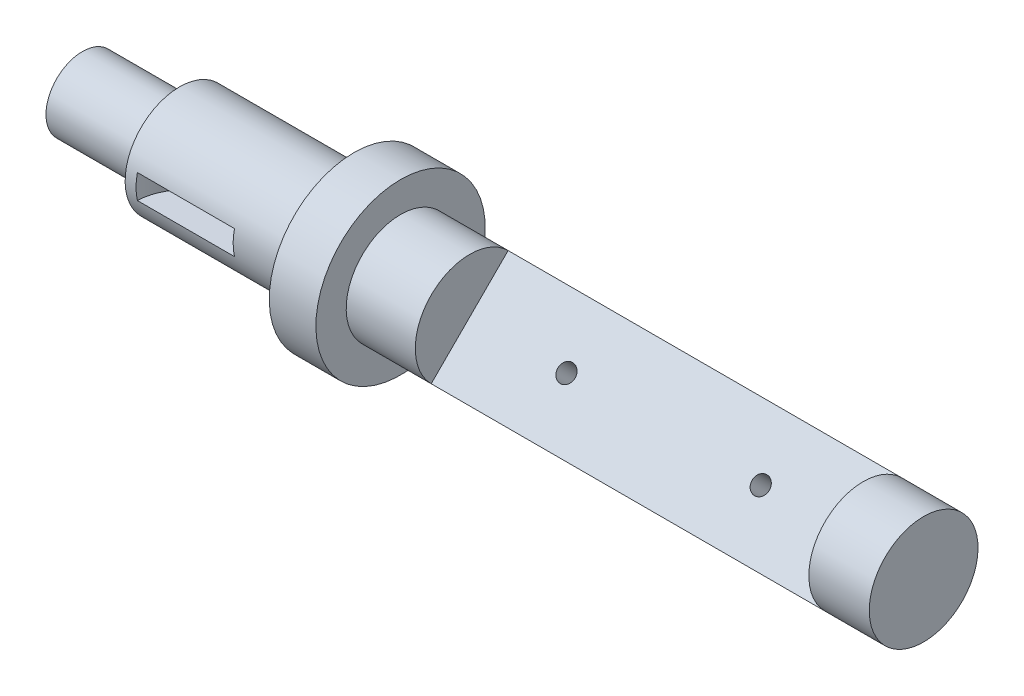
ISO-10303-21;
HEADER;
FILE_DESCRIPTION(('STEP AP214'),'2;1');
FILE_NAME('part.step','',(''),(''),'','','');
FILE_SCHEMA(('AUTOMOTIVE_DESIGN { 1 0 10303 214 1 1 1 1 }'));
ENDSEC;
DATA;
#1=APPLICATION_CONTEXT('core data for automotive mechanical design processes');
#2=APPLICATION_PROTOCOL_DEFINITION('international standard','automotive_design',2000,#1);
#3=PRODUCT_CONTEXT('',#1,'mechanical');
#4=PRODUCT('Part','Part','',(#3));
#5=PRODUCT_RELATED_PRODUCT_CATEGORY('part','',(#4));
#6=PRODUCT_DEFINITION_FORMATION('','',#4);
#7=PRODUCT_DEFINITION_CONTEXT('part definition',#1,'design');
#8=PRODUCT_DEFINITION('design','',#6,#7);
#9=PRODUCT_DEFINITION_SHAPE('','',#8);
#10=(LENGTH_UNIT() NAMED_UNIT(*) SI_UNIT(.MILLI.,.METRE.));
#11=(NAMED_UNIT(*) PLANE_ANGLE_UNIT() SI_UNIT($,.RADIAN.));
#12=(NAMED_UNIT(*) SI_UNIT($,.STERADIAN.) SOLID_ANGLE_UNIT());
#13=UNCERTAINTY_MEASURE_WITH_UNIT(LENGTH_MEASURE(1.E-05),#10,'distance_accuracy_value','');
#14=(GEOMETRIC_REPRESENTATION_CONTEXT(3) GLOBAL_UNCERTAINTY_ASSIGNED_CONTEXT((#13)) GLOBAL_UNIT_ASSIGNED_CONTEXT((#10,
#11,#12)) REPRESENTATION_CONTEXT('',''));
#15=CARTESIAN_POINT('',(0.,0.,0.));
#16=DIRECTION('',(0.,0.,1.));
#17=DIRECTION('',(1.,0.,0.));
#18=AXIS2_PLACEMENT_3D('',#15,#16,#17);
#19=CARTESIAN_POINT('',(102.,0.,0.));
#20=DIRECTION('',(1.,0.,0.));
#21=DIRECTION('',(0.,1.,0.));
#22=AXIS2_PLACEMENT_3D('',#19,#20,#21);
#23=CYLINDRICAL_SURFACE('',#22,7.11199999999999);
#24=DIRECTION('',(1.,0.,0.));
#25=VECTOR('',#24,1.);
#26=CARTESIAN_POINT('',(102.,-1.58749999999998,6.93255997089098));
#27=LINE('',#26,#25);
#28=CARTESIAN_POINT('',(6.12493583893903,-1.58749999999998,6.93255997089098));
#29=VERTEX_POINT('',#28);
#30=CARTESIAN_POINT('',(18.819864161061,-1.58749999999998,6.93255997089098));
#31=VERTEX_POINT('',#30);
#32=EDGE_CURVE('E13',#29,#31,#27,.T.);
#33=ORIENTED_EDGE('',*,*,#32,.F.);
#34=CARTESIAN_POINT('',(6.12493583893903,1.58750000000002,6.93255997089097));
#35=CARTESIAN_POINT('',(6.12430253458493,1.48918668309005,6.95507276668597));
#36=CARTESIAN_POINT('',(6.12384159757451,1.39040619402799,6.97549148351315));
#37=CARTESIAN_POINT('',(6.12315874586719,1.19206519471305,7.01211079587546));
#38=CARTESIAN_POINT('',(6.12293683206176,1.09250468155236,7.02831137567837));
#39=CARTESIAN_POINT('',(6.12247098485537,0.792837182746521,7.07054757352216));
#40=CARTESIAN_POINT('',(6.12242715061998,0.591792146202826,7.09020668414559));
#41=CARTESIAN_POINT('',(6.12239127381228,0.192533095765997,7.11215309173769));
#42=CARTESIAN_POINT('',(6.1223982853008,-0.00566422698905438,7.11475596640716));
#43=CARTESIAN_POINT('',(6.12240305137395,-0.401492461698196,7.10341548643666));
#44=CARTESIAN_POINT('',(6.12240081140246,-0.599123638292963,7.08948186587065));
#45=CARTESIAN_POINT('',(6.12266247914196,-0.928464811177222,7.05239884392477));
#46=CARTESIAN_POINT('',(6.1228400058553,-1.0606961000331,7.03372456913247));
#47=CARTESIAN_POINT('',(6.12355784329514,-1.32473608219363,6.98882477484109));
#48=CARTESIAN_POINT('',(6.12410045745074,-1.45653671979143,6.96255191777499));
#49=CARTESIAN_POINT('',(6.12493583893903,-1.58749999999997,6.93255997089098));
#50=B_SPLINE_CURVE_WITH_KNOTS('',3,(#34,#35,#36,#37,#38,#39,#40,#41,#42,#43,#44,#45,#46,#47,#48,
#49),.UNSPECIFIED.,.F.,.F.,(4,2,2,2,2,2,2,4),(0.,0.302530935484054,0.605062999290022,
1.21027408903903,1.80425504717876,2.39788653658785,2.79831956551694,3.20130301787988),.UNSPECIFIED.);
#51=CARTESIAN_POINT('',(6.12493583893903,1.58750000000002,6.93255997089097));
#52=VERTEX_POINT('',#51);
#53=EDGE_CURVE('E89',#52,#29,#50,.T.);
#54=ORIENTED_EDGE('',*,*,#53,.F.);
#55=DIRECTION('',(1.,0.,0.));
#56=VECTOR('',#55,1.);
#57=CARTESIAN_POINT('',(102.,1.58750000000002,6.93255997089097));
#58=LINE('',#57,#56);
#59=CARTESIAN_POINT('',(18.819864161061,1.58750000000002,6.93255997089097));
#60=VERTEX_POINT('',#59);
#61=EDGE_CURVE('E85',#52,#60,#58,.T.);
#62=ORIENTED_EDGE('',*,*,#61,.T.);
#63=CARTESIAN_POINT('',(18.819864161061,-1.58749999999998,6.93255997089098));
#64=CARTESIAN_POINT('',(18.8204974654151,-1.48918668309,6.95507276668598));
#65=CARTESIAN_POINT('',(18.8209584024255,-1.39040619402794,6.97549148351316));
#66=CARTESIAN_POINT('',(18.8216412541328,-1.192065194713,7.01211079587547));
#67=CARTESIAN_POINT('',(18.8218631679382,-1.09250468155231,7.02831137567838));
#68=CARTESIAN_POINT('',(18.8223290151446,-0.79283718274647,7.07054757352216));
#69=CARTESIAN_POINT('',(18.82237284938,-0.591792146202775,7.0902066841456));
#70=CARTESIAN_POINT('',(18.8224087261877,-0.192533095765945,7.11215309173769));
#71=CARTESIAN_POINT('',(18.8224017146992,0.00566422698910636,7.11475596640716));
#72=CARTESIAN_POINT('',(18.822396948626,0.401492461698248,7.10341548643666));
#73=CARTESIAN_POINT('',(18.8223991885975,0.599123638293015,7.08948186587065));
#74=CARTESIAN_POINT('',(18.822137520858,0.928464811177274,7.05239884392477));
#75=CARTESIAN_POINT('',(18.8219599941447,1.06069610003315,7.03372456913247));
#76=CARTESIAN_POINT('',(18.8212421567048,1.32473608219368,6.98882477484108));
#77=CARTESIAN_POINT('',(18.8206995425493,1.45653671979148,6.96255191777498));
#78=CARTESIAN_POINT('',(18.819864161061,1.58750000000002,6.93255997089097));
#79=B_SPLINE_CURVE_WITH_KNOTS('',3,(#63,#64,#65,#66,#67,#68,#69,#70,#71,#72,#73,#74,#75,#76,#77,
#78),.UNSPECIFIED.,.F.,.F.,(4,2,2,2,2,2,2,4),(0.,0.302530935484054,0.605062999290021,
1.21027408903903,1.80425504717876,2.39788653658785,2.79831956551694,3.20130301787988),.UNSPECIFIED.);
#80=EDGE_CURVE('E54',#31,#60,#79,.T.);
#81=ORIENTED_EDGE('',*,*,#80,.F.);
#82=EDGE_LOOP('',(#33,#54,#62,#81));
#83=FACE_BOUND('',#82,.T.);
#84=CARTESIAN_POINT('',(27.5092,0.,0.));
#85=DIRECTION('',(1.,0.,0.));
#86=DIRECTION('',(0.,1.,0.));
#87=AXIS2_PLACEMENT_3D('',#84,#85,#86);
#88=CIRCLE('',#87,7.11199999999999);
#89=CARTESIAN_POINT('',(27.5092,7.11199999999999,0.));
#90=VERTEX_POINT('',#89);
#91=EDGE_CURVE('E182',#90,#90,#88,.T.);
#92=ORIENTED_EDGE('',*,*,#91,.F.);
#93=EDGE_LOOP('',(#92));
#94=FACE_BOUND('',#93,.T.);
#95=CARTESIAN_POINT('',(4.7,0.,0.));
#96=DIRECTION('',(1.,0.,0.));
#97=DIRECTION('',(0.,1.,0.));
#98=AXIS2_PLACEMENT_3D('',#95,#96,#97);
#99=CIRCLE('',#98,7.112);
#100=CARTESIAN_POINT('',(4.7,7.112,0.));
#101=VERTEX_POINT('',#100);
#102=EDGE_CURVE('E185',#101,#101,#99,.T.);
#103=ORIENTED_EDGE('',*,*,#102,.T.);
#104=EDGE_LOOP('',(#103));
#105=FACE_BOUND('',#104,.T.);
#106=ADVANCED_FACE('F46',(#83,#94,#105),#23,.T.);
#107=CARTESIAN_POINT('',(-8.,0.,0.));
#108=DIRECTION('',(-1.,0.,0.));
#109=DIRECTION('',(0.,-1.,0.));
#110=AXIS2_PLACEMENT_3D('',#107,#108,#109);
#111=PLANE('',#110);
#112=CARTESIAN_POINT('',(-8.00000000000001,0.,0.));
#113=DIRECTION('',(1.,0.,0.));
#114=DIRECTION('',(0.,1.,0.));
#115=AXIS2_PLACEMENT_3D('',#112,#113,#114);
#116=CIRCLE('',#115,4.7625);
#117=CARTESIAN_POINT('',(-8.00000000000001,4.7625,0.));
#118=VERTEX_POINT('',#117);
#119=EDGE_CURVE('E90',#118,#118,#116,.T.);
#120=ORIENTED_EDGE('',*,*,#119,.F.);
#121=EDGE_LOOP('',(#120));
#122=FACE_BOUND('',#121,.T.);
#123=ADVANCED_FACE('F48',(#122),#111,.T.);
#124=CARTESIAN_POINT('',(102.,0.,0.));
#125=DIRECTION('',(1.,0.,0.));
#126=DIRECTION('',(0.,1.,0.));
#127=AXIS2_PLACEMENT_3D('',#124,#125,#126);
#128=CYLINDRICAL_SURFACE('',#127,4.7625);
#129=ORIENTED_EDGE('',*,*,#119,.T.);
#130=EDGE_LOOP('',(#129));
#131=FACE_BOUND('',#130,.T.);
#132=CARTESIAN_POINT('',(4.7,0.,0.));
#133=DIRECTION('',(1.,0.,0.));
#134=DIRECTION('',(0.,1.,0.));
#135=AXIS2_PLACEMENT_3D('',#132,#133,#134);
#136=CIRCLE('',#135,4.7625);
#137=CARTESIAN_POINT('',(4.7,4.7625,0.));
#138=VERTEX_POINT('',#137);
#139=EDGE_CURVE('E188',#138,#138,#136,.T.);
#140=ORIENTED_EDGE('',*,*,#139,.F.);
#141=EDGE_LOOP('',(#140));
#142=FACE_BOUND('',#141,.T.);
#143=ADVANCED_FACE('F193',(#131,#142),#128,.T.);
#144=CARTESIAN_POINT('',(4.7,4.7625,0.));
#145=DIRECTION('',(-1.,0.,0.));
#146=DIRECTION('',(0.,-1.,0.));
#147=AXIS2_PLACEMENT_3D('',#144,#145,#146);
#148=PLANE('',#147);
#149=ORIENTED_EDGE('',*,*,#139,.T.);
#150=EDGE_LOOP('',(#149));
#151=FACE_BOUND('',#150,.T.);
#152=ORIENTED_EDGE('',*,*,#102,.F.);
#153=EDGE_LOOP('',(#152));
#154=FACE_BOUND('',#153,.T.);
#155=ADVANCED_FACE('F201',(#151,#154),#148,.T.);
#156=CARTESIAN_POINT('',(27.5092,7.11199999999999,0.));
#157=DIRECTION('',(-1.,0.,0.));
#158=DIRECTION('',(0.,-1.,0.));
#159=AXIS2_PLACEMENT_3D('',#156,#157,#158);
#160=PLANE('',#159);
#161=ORIENTED_EDGE('',*,*,#91,.T.);
#162=EDGE_LOOP('',(#161));
#163=FACE_BOUND('',#162,.T.);
#164=CARTESIAN_POINT('',(27.5092,0.,0.));
#165=DIRECTION('',(1.,0.,0.));
#166=DIRECTION('',(0.,1.,0.));
#167=AXIS2_PLACEMENT_3D('',#164,#165,#166);
#168=CIRCLE('',#167,11.0744);
#169=CARTESIAN_POINT('',(27.5092,11.0744,0.));
#170=VERTEX_POINT('',#169);
#171=EDGE_CURVE('E179',#170,#170,#168,.T.);
#172=ORIENTED_EDGE('',*,*,#171,.F.);
#173=EDGE_LOOP('',(#172));
#174=FACE_BOUND('',#173,.T.);
#175=ADVANCED_FACE('F316',(#163,#174),#160,.T.);
#176=CARTESIAN_POINT('',(102.,0.,0.));
#177=DIRECTION('',(1.,0.,0.));
#178=DIRECTION('',(0.,1.,0.));
#179=AXIS2_PLACEMENT_3D('',#176,#177,#178);
#180=CYLINDRICAL_SURFACE('',#179,11.0744);
#181=ORIENTED_EDGE('',*,*,#171,.T.);
#182=EDGE_LOOP('',(#181));
#183=FACE_BOUND('',#182,.T.);
#184=CARTESIAN_POINT('',(33.6052,0.,0.));
#185=DIRECTION('',(1.,0.,0.));
#186=DIRECTION('',(0.,1.,0.));
#187=AXIS2_PLACEMENT_3D('',#184,#185,#186);
#188=CIRCLE('',#187,11.0744);
#189=CARTESIAN_POINT('',(33.6052,11.0744,0.));
#190=VERTEX_POINT('',#189);
#191=EDGE_CURVE('E176',#190,#190,#188,.T.);
#192=ORIENTED_EDGE('',*,*,#191,.F.);
#193=EDGE_LOOP('',(#192));
#194=FACE_BOUND('',#193,.T.);
#195=ADVANCED_FACE('F308',(#183,#194),#180,.T.);
#196=CARTESIAN_POINT('',(33.6052,11.0744,0.));
#197=DIRECTION('',(1.,0.,0.));
#198=DIRECTION('',(0.,1.,0.));
#199=AXIS2_PLACEMENT_3D('',#196,#197,#198);
#200=PLANE('',#199);
#201=ORIENTED_EDGE('',*,*,#191,.T.);
#202=EDGE_LOOP('',(#201));
#203=FACE_BOUND('',#202,.T.);
#204=CARTESIAN_POINT('',(33.6052,0.,0.));
#205=DIRECTION('',(1.,0.,0.));
#206=DIRECTION('',(0.,1.,0.));
#207=AXIS2_PLACEMENT_3D('',#204,#205,#206);
#208=CIRCLE('',#207,7.11199999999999);
#209=CARTESIAN_POINT('',(33.6052,7.11199999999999,0.));
#210=VERTEX_POINT('',#209);
#211=EDGE_CURVE('E173',#210,#210,#208,.T.);
#212=ORIENTED_EDGE('',*,*,#211,.F.);
#213=EDGE_LOOP('',(#212));
#214=FACE_BOUND('',#213,.T.);
#215=ADVANCED_FACE('F146',(#203,#214),#200,.T.);
#216=CARTESIAN_POINT('',(102.,0.,0.));
#217=DIRECTION('',(1.,0.,0.));
#218=DIRECTION('',(0.,1.,0.));
#219=AXIS2_PLACEMENT_3D('',#216,#217,#218);
#220=CYLINDRICAL_SURFACE('',#219,7.11199999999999);
#221=CARTESIAN_POINT('',(80.696799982,-5.76426877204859,-4.16578318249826));
#222=CARTESIAN_POINT('',(80.6337421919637,-5.76426773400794,-4.16578577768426));
#223=CARTESIAN_POINT('',(80.5706489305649,-5.76113199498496,-4.17013425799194));
#224=CARTESIAN_POINT('',(80.4462297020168,-5.74862575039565,-4.18735655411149));
#225=CARTESIAN_POINT('',(80.384905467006,-5.73924933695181,-4.20023844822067));
#226=CARTESIAN_POINT('',(80.2658430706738,-5.71440168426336,-4.23398079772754));
#227=CARTESIAN_POINT('',(80.2081020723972,-5.69893533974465,-4.25483484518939));
#228=CARTESIAN_POINT('',(80.0977560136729,-5.66213262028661,-4.30368785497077));
#229=CARTESIAN_POINT('',(80.0451503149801,-5.64079697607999,-4.33168592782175));
#230=CARTESIAN_POINT('',(79.9460889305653,-5.59237769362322,-4.39402108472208));
#231=CARTESIAN_POINT('',(79.8996860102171,-5.56524928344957,-4.4284072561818));
#232=CARTESIAN_POINT('',(79.8148051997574,-5.50579084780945,-4.50211604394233));
#233=CARTESIAN_POINT('',(79.7763277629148,-5.47346052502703,-4.54143894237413));
#234=CARTESIAN_POINT('',(79.7081936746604,-5.40400354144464,-4.62387346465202));
#235=CARTESIAN_POINT('',(79.6785858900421,-5.36685186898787,-4.66700444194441));
#236=CARTESIAN_POINT('',(79.6293454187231,-5.28868162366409,-4.75540406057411));
#237=CARTESIAN_POINT('',(79.6097121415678,-5.24766327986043,-4.80067257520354));
#238=CARTESIAN_POINT('',(79.5811387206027,-5.1631146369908,-4.89148298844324));
#239=CARTESIAN_POINT('',(79.5721100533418,-5.11960835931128,-4.93701938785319));
#240=CARTESIAN_POINT('',(79.5647270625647,-5.03094384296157,-5.02734040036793));
#241=CARTESIAN_POINT('',(79.5663720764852,-4.9857857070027,-5.07212505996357));
#242=CARTESIAN_POINT('',(79.5802203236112,-4.89554999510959,-5.15926687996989));
#243=CARTESIAN_POINT('',(79.5923283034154,-4.85047535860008,-5.20164227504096));
#244=CARTESIAN_POINT('',(79.6266090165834,-4.76138132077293,-5.28331777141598));
#245=CARTESIAN_POINT('',(79.6487820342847,-4.71736194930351,-5.32261778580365));
#246=CARTESIAN_POINT('',(79.7026594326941,-4.63160602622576,-5.39740898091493));
#247=CARTESIAN_POINT('',(79.7344034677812,-4.58987984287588,-5.4328834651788));
#248=CARTESIAN_POINT('',(79.8064928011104,-4.51030134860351,-5.49912816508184));
#249=CARTESIAN_POINT('',(79.8468387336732,-4.47244932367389,-5.52989803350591));
#250=CARTESIAN_POINT('',(79.9355160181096,-4.40154380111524,-5.58650526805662));
#251=CARTESIAN_POINT('',(79.9839305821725,-4.3685478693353,-5.61228445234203));
#252=CARTESIAN_POINT('',(80.0870893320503,-4.30908614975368,-5.65806797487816));
#253=CARTESIAN_POINT('',(80.1418335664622,-4.28262041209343,-5.67807226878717));
#254=CARTESIAN_POINT('',(80.2561879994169,-4.23723471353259,-5.71202187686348));
#255=CARTESIAN_POINT('',(80.3158027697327,-4.21832194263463,-5.72596141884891));
#256=CARTESIAN_POINT('',(80.4381563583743,-4.18886315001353,-5.74754784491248));
#257=CARTESIAN_POINT('',(80.5008949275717,-4.17831646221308,-5.75519522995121));
#258=CARTESIAN_POINT('',(80.6269848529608,-4.16610850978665,-5.76403859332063));
#259=CARTESIAN_POINT('',(80.6903221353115,-4.16435190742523,-5.76530379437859));
#260=CARTESIAN_POINT('',(80.8164497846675,-4.16954129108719,-5.76155181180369));
#261=CARTESIAN_POINT('',(80.8792401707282,-4.17648697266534,-5.75653484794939));
#262=CARTESIAN_POINT('',(81.0021263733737,-4.19872046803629,-5.74033761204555));
#263=CARTESIAN_POINT('',(81.0622354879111,-4.21396059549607,-5.72919256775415));
#264=CARTESIAN_POINT('',(81.1784736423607,-4.25212929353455,-5.70092107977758));
#265=CARTESIAN_POINT('',(81.2346024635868,-4.27505828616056,-5.68379430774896));
#266=CARTESIAN_POINT('',(81.3418064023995,-4.32793571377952,-5.64363568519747));
#267=CARTESIAN_POINT('',(81.3928349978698,-4.35794161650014,-5.62055533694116));
#268=CARTESIAN_POINT('',(81.4879103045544,-4.42374276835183,-5.56891271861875));
#269=CARTESIAN_POINT('',(81.5319565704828,-4.45953838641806,-5.54035009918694));
#270=CARTESIAN_POINT('',(81.6122384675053,-4.53600260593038,-5.47792646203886));
#271=CARTESIAN_POINT('',(81.6483967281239,-4.57671387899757,-5.44401813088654));
#272=CARTESIAN_POINT('',(81.7113356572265,-4.66131720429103,-5.37175542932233));
#273=CARTESIAN_POINT('',(81.7381166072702,-4.70520916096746,-5.33340119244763));
#274=CARTESIAN_POINT('',(81.781418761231,-4.79451795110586,-5.25325837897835));
#275=CARTESIAN_POINT('',(81.7979813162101,-4.83992784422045,-5.21148442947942));
#276=CARTESIAN_POINT('',(81.8205100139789,-4.93098338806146,-5.12541402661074));
#277=CARTESIAN_POINT('',(81.82647694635,-4.97662902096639,-5.08111776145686));
#278=CARTESIAN_POINT('',(81.8276239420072,-5.06627316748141,-4.99173149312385));
#279=CARTESIAN_POINT('',(81.8229220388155,-5.11028428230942,-4.94665559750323));
#280=CARTESIAN_POINT('',(81.8031190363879,-5.19597176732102,-4.8565715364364));
#281=CARTESIAN_POINT('',(81.788017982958,-5.23764814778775,-4.81156337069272));
#282=CARTESIAN_POINT('',(81.747889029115,-5.31759462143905,-4.72305912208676));
#283=CARTESIAN_POINT('',(81.7228702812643,-5.35586781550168,-4.6795616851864));
#284=CARTESIAN_POINT('',(81.6636289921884,-5.42821747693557,-4.59544130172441));
#285=CARTESIAN_POINT('',(81.6294060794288,-5.46229377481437,-4.55481847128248));
#286=CARTESIAN_POINT('',(81.5523054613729,-5.52593161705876,-4.47740601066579));
#287=CARTESIAN_POINT('',(81.5093409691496,-5.55544220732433,-4.44066092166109));
#288=CARTESIAN_POINT('',(81.416159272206,-5.60901484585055,-4.3727989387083));
#289=CARTESIAN_POINT('',(81.3659403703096,-5.63307561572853,-4.3416833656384));
#290=CARTESIAN_POINT('',(81.2592972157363,-5.67550049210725,-4.28607894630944));
#291=CARTESIAN_POINT('',(81.2028354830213,-5.69382734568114,-4.26163356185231));
#292=CARTESIAN_POINT('',(81.0855891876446,-5.72428687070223,-4.22063286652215));
#293=CARTESIAN_POINT('',(81.0248090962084,-5.73642584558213,-4.20406952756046));
#294=CARTESIAN_POINT('',(80.9192788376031,-5.75166922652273,-4.18317509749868));
#295=CARTESIAN_POINT('',(80.8751739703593,-5.7563901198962,-4.17666683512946));
#296=CARTESIAN_POINT('',(80.786318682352,-5.76269023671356,-4.16796998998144));
#297=CARTESIAN_POINT('',(80.7415682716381,-5.76426950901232,-4.16578134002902));
#298=CARTESIAN_POINT('',(80.696799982,-5.76426877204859,-4.16578318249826));
#299=B_SPLINE_CURVE_WITH_KNOTS('',3,(#221,#222,#223,#224,#225,#226,#227,#228,#229,#230,#231,
#232,#233,#234,#235,#236,#237,#238,#239,#240,#241,#242,#243,#244,#245,#246,#247,#248,#249,#250,
#251,#252,#253,#254,#255,#256,#257,#258,#259,#260,#261,#262,#263,#264,#265,#266,#267,#268,#269,
#270,#271,#272,#273,#274,#275,#276,#277,#278,#279,#280,#281,#282,#283,#284,#285,#286,#287,#288,
#289,#290,#291,#292,#293,#294,#295,#296,#297,#298),.UNSPECIFIED.,.T.,.F.,(4,2,2,2,2,2,2,2,2,2,2,
2,2,2,2,2,2,2,2,2,2,2,2,2,2,2,2,2,2,2,2,2,2,2,2,2,2,2,4),(0.,0.189009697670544,
0.378198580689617,0.567235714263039,0.756249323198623,0.946780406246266,1.13732238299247,
1.32889560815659,1.52045749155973,1.71040865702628,1.90034803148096,2.08857622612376,
2.27680973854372,2.46583410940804,2.65487242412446,2.84599693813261,3.03712291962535,
3.22843041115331,3.41972266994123,3.60893559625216,3.79814190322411,3.98627174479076,
4.17441191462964,4.36413592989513,4.55387203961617,4.74539295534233,4.93690812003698,
5.12764310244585,5.31836387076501,5.5069849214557,5.6956051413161,5.88405169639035,
6.07250585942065,6.2629313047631,6.4534013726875,6.64508438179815,6.83657173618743,
6.97076249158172,7.10495116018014),.UNSPECIFIED.);
#300=CARTESIAN_POINT('',(80.696799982,-5.76426877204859,-4.16578318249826));
#301=VERTEX_POINT('',#300);
#302=EDGE_CURVE('E129',#301,#301,#299,.T.);
#303=ORIENTED_EDGE('',*,*,#302,.F.);
#304=EDGE_LOOP('',(#303));
#305=FACE_BOUND('',#304,.T.);
#306=CARTESIAN_POINT('',(55.296799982,-5.76426877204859,-4.16578318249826));
#307=CARTESIAN_POINT('',(55.2337421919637,-5.76426773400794,-4.16578577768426));
#308=CARTESIAN_POINT('',(55.1706489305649,-5.76113199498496,-4.17013425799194));
#309=CARTESIAN_POINT('',(55.0462297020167,-5.74862575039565,-4.18735655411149));
#310=CARTESIAN_POINT('',(54.984905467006,-5.73924933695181,-4.20023844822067));
#311=CARTESIAN_POINT('',(54.8658430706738,-5.71440168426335,-4.23398079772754));
#312=CARTESIAN_POINT('',(54.8081020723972,-5.69893533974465,-4.25483484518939));
#313=CARTESIAN_POINT('',(54.6977560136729,-5.66213262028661,-4.30368785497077));
#314=CARTESIAN_POINT('',(54.6451503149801,-5.64079697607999,-4.33168592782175));
#315=CARTESIAN_POINT('',(54.5460889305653,-5.59237769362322,-4.39402108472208));
#316=CARTESIAN_POINT('',(54.4996860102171,-5.56524928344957,-4.4284072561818));
#317=CARTESIAN_POINT('',(54.4148051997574,-5.50579084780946,-4.50211604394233));
#318=CARTESIAN_POINT('',(54.3763277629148,-5.47346052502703,-4.54143894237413));
#319=CARTESIAN_POINT('',(54.3081936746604,-5.40400354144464,-4.62387346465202));
#320=CARTESIAN_POINT('',(54.2785858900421,-5.36685186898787,-4.66700444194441));
#321=CARTESIAN_POINT('',(54.2293454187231,-5.28868162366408,-4.75540406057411));
#322=CARTESIAN_POINT('',(54.2097121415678,-5.24766327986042,-4.80067257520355));
#323=CARTESIAN_POINT('',(54.1811387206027,-5.16311463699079,-4.89148298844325));
#324=CARTESIAN_POINT('',(54.1721100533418,-5.11960835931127,-4.9370193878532));
#325=CARTESIAN_POINT('',(54.1647270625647,-5.03094384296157,-5.02734040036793));
#326=CARTESIAN_POINT('',(54.1663720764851,-4.9857857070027,-5.07212505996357));
#327=CARTESIAN_POINT('',(54.1802203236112,-4.89554999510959,-5.15926687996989));
#328=CARTESIAN_POINT('',(54.1923283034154,-4.85047535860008,-5.20164227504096));
#329=CARTESIAN_POINT('',(54.2266090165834,-4.76138132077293,-5.28331777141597));
#330=CARTESIAN_POINT('',(54.2487820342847,-4.71736194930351,-5.32261778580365));
#331=CARTESIAN_POINT('',(54.3026594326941,-4.63160602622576,-5.39740898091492));
#332=CARTESIAN_POINT('',(54.3344034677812,-4.58987984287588,-5.43288346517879));
#333=CARTESIAN_POINT('',(54.4064928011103,-4.51030134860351,-5.49912816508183));
#334=CARTESIAN_POINT('',(54.4468387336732,-4.47244932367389,-5.5298980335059));
#335=CARTESIAN_POINT('',(54.5355160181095,-4.40154380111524,-5.58650526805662));
#336=CARTESIAN_POINT('',(54.5839305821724,-4.3685478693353,-5.61228445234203));
#337=CARTESIAN_POINT('',(54.6870893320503,-4.30908614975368,-5.65806797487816));
#338=CARTESIAN_POINT('',(54.7418335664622,-4.28262041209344,-5.67807226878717));
#339=CARTESIAN_POINT('',(54.8561879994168,-4.23723471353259,-5.71202187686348));
#340=CARTESIAN_POINT('',(54.9158027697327,-4.21832194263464,-5.72596141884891));
#341=CARTESIAN_POINT('',(55.0381563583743,-4.18886315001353,-5.74754784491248));
#342=CARTESIAN_POINT('',(55.1008949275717,-4.17831646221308,-5.75519522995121));
#343=CARTESIAN_POINT('',(55.2269848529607,-4.16610850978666,-5.76403859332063));
#344=CARTESIAN_POINT('',(55.2903221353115,-4.16435190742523,-5.76530379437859));
#345=CARTESIAN_POINT('',(55.4164497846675,-4.16954129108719,-5.7615518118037));
#346=CARTESIAN_POINT('',(55.4792401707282,-4.17648697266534,-5.75653484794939));
#347=CARTESIAN_POINT('',(55.6021263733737,-4.19872046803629,-5.74033761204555));
#348=CARTESIAN_POINT('',(55.6622354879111,-4.21396059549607,-5.72919256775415));
#349=CARTESIAN_POINT('',(55.7784736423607,-4.25212929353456,-5.70092107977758));
#350=CARTESIAN_POINT('',(55.8346024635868,-4.27505828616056,-5.68379430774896));
#351=CARTESIAN_POINT('',(55.9418064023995,-4.32793571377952,-5.64363568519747));
#352=CARTESIAN_POINT('',(55.9928349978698,-4.35794161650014,-5.62055533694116));
#353=CARTESIAN_POINT('',(56.0879103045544,-4.42374276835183,-5.56891271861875));
#354=CARTESIAN_POINT('',(56.1319565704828,-4.45953838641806,-5.54035009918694));
#355=CARTESIAN_POINT('',(56.2122384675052,-4.53600260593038,-5.47792646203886));
#356=CARTESIAN_POINT('',(56.2483967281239,-4.57671387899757,-5.44401813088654));
#357=CARTESIAN_POINT('',(56.3113356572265,-4.66131720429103,-5.37175542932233));
#358=CARTESIAN_POINT('',(56.3381166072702,-4.70520916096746,-5.33340119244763));
#359=CARTESIAN_POINT('',(56.381418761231,-4.79451795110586,-5.25325837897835));
#360=CARTESIAN_POINT('',(56.3979813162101,-4.83992784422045,-5.21148442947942));
#361=CARTESIAN_POINT('',(56.4205100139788,-4.93098338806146,-5.12541402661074));
#362=CARTESIAN_POINT('',(56.4264769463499,-4.97662902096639,-5.08111776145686));
#363=CARTESIAN_POINT('',(56.4276239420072,-5.06627316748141,-4.99173149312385));
#364=CARTESIAN_POINT('',(56.4229220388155,-5.11028428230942,-4.94665559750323));
#365=CARTESIAN_POINT('',(56.4031190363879,-5.19597176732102,-4.85657153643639));
#366=CARTESIAN_POINT('',(56.388017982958,-5.23764814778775,-4.81156337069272));
#367=CARTESIAN_POINT('',(56.347889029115,-5.31759462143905,-4.72305912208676));
#368=CARTESIAN_POINT('',(56.3228702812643,-5.35586781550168,-4.6795616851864));
#369=CARTESIAN_POINT('',(56.2636289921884,-5.42821747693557,-4.59544130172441));
#370=CARTESIAN_POINT('',(56.2294060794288,-5.46229377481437,-4.55481847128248));
#371=CARTESIAN_POINT('',(56.1523054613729,-5.52593161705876,-4.47740601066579));
#372=CARTESIAN_POINT('',(56.1093409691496,-5.55544220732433,-4.44066092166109));
#373=CARTESIAN_POINT('',(56.016159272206,-5.60901484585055,-4.37279893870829));
#374=CARTESIAN_POINT('',(55.9659403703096,-5.63307561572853,-4.3416833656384));
#375=CARTESIAN_POINT('',(55.8592972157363,-5.67550049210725,-4.28607894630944));
#376=CARTESIAN_POINT('',(55.8028354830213,-5.69382734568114,-4.26163356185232));
#377=CARTESIAN_POINT('',(55.6855891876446,-5.72428687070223,-4.22063286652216));
#378=CARTESIAN_POINT('',(55.6248090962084,-5.73642584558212,-4.20406952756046));
#379=CARTESIAN_POINT('',(55.5192788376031,-5.75166922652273,-4.18317509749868));
#380=CARTESIAN_POINT('',(55.4751739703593,-5.7563901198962,-4.17666683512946));
#381=CARTESIAN_POINT('',(55.386318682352,-5.76269023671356,-4.16796998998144));
#382=CARTESIAN_POINT('',(55.3415682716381,-5.76426950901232,-4.16578134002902));
#383=CARTESIAN_POINT('',(55.296799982,-5.76426877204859,-4.16578318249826));
#384=B_SPLINE_CURVE_WITH_KNOTS('',3,(#306,#307,#308,#309,#310,#311,#312,#313,#314,#315,#316,
#317,#318,#319,#320,#321,#322,#323,#324,#325,#326,#327,#328,#329,#330,#331,#332,#333,#334,#335,
#336,#337,#338,#339,#340,#341,#342,#343,#344,#345,#346,#347,#348,#349,#350,#351,#352,#353,#354,
#355,#356,#357,#358,#359,#360,#361,#362,#363,#364,#365,#366,#367,#368,#369,#370,#371,#372,#373,
#374,#375,#376,#377,#378,#379,#380,#381,#382,#383),.UNSPECIFIED.,.T.,.F.,(4,2,2,2,2,2,2,2,2,2,2,
2,2,2,2,2,2,2,2,2,2,2,2,2,2,2,2,2,2,2,2,2,2,2,2,2,2,2,4),(0.,0.189009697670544,
0.378198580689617,0.567235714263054,0.756249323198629,0.946780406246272,1.13732238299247,
1.3288956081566,1.52045749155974,1.71040865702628,1.90034803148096,2.08857622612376,
2.27680973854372,2.46583410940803,2.65487242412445,2.84599693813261,3.03712291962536,
3.22843041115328,3.41972266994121,3.60893559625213,3.79814190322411,3.98627174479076,
4.17441191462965,4.36413592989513,4.55387203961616,4.74539295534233,4.93690812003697,
5.12764310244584,5.31836387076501,5.5069849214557,5.69560514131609,5.88405169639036,
6.07250585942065,6.2629313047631,6.45340137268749,6.64508438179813,6.83657173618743,
6.97076249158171,7.10495116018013),.UNSPECIFIED.);
#385=CARTESIAN_POINT('',(55.296799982,-5.76426877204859,-4.16578318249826));
#386=VERTEX_POINT('',#385);
#387=EDGE_CURVE('E151',#386,#386,#384,.T.);
#388=ORIENTED_EDGE('',*,*,#387,.F.);
#389=EDGE_LOOP('',(#388));
#390=FACE_BOUND('',#389,.T.);
#391=DIRECTION('',(-1.,0.,0.));
#392=VECTOR('',#391,1.);
#393=CARTESIAN_POINT('',(94.1006,5.02894342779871,-5.02894342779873));
#394=LINE('',#393,#392);
#395=CARTESIAN_POINT('',(94.1006,5.02894342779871,-5.02894342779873));
#396=VERTEX_POINT('',#395);
#397=CARTESIAN_POINT('',(42.6386,5.02894342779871,-5.02894342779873));
#398=VERTEX_POINT('',#397);
#399=EDGE_CURVE('E162',#396,#398,#394,.T.);
#400=ORIENTED_EDGE('',*,*,#399,.F.);
#401=CARTESIAN_POINT('',(94.1006,0.,0.));
#402=DIRECTION('',(-1.,0.,0.));
#403=DIRECTION('',(0.,0.,1.));
#404=AXIS2_PLACEMENT_3D('',#401,#402,#403);
#405=CIRCLE('',#404,7.11199999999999);
#406=CARTESIAN_POINT('',(94.1006,-5.02894342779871,5.02894342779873));
#407=VERTEX_POINT('',#406);
#408=EDGE_CURVE('E157',#407,#396,#405,.T.);
#409=ORIENTED_EDGE('',*,*,#408,.F.);
#410=DIRECTION('',(1.,0.,0.));
#411=VECTOR('',#410,1.);
#412=CARTESIAN_POINT('',(94.1006,-5.02894342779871,5.02894342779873));
#413=LINE('',#412,#411);
#414=CARTESIAN_POINT('',(42.6386,-5.02894342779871,5.02894342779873));
#415=VERTEX_POINT('',#414);
#416=EDGE_CURVE('E167',#415,#407,#413,.T.);
#417=ORIENTED_EDGE('',*,*,#416,.F.);
#418=CARTESIAN_POINT('',(42.6386,0.,0.));
#419=DIRECTION('',(1.,0.,0.));
#420=DIRECTION('',(0.,0.,-1.));
#421=AXIS2_PLACEMENT_3D('',#418,#419,#420);
#422=CIRCLE('',#421,7.11199999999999);
#423=EDGE_CURVE('E67',#398,#415,#422,.T.);
#424=ORIENTED_EDGE('',*,*,#423,.F.);
#425=EDGE_LOOP('',(#400,#409,#417,#424));
#426=FACE_BOUND('',#425,.T.);
#427=ORIENTED_EDGE('',*,*,#211,.T.);
#428=EDGE_LOOP('',(#427));
#429=FACE_BOUND('',#428,.T.);
#430=CARTESIAN_POINT('',(102.,0.,0.));
#431=DIRECTION('',(1.,0.,0.));
#432=DIRECTION('',(0.,1.,0.));
#433=AXIS2_PLACEMENT_3D('',#430,#431,#432);
#434=CIRCLE('',#433,7.11199999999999);
#435=CARTESIAN_POINT('',(102.,7.11199999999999,0.));
#436=VERTEX_POINT('',#435);
#437=EDGE_CURVE('E170',#436,#436,#434,.T.);
#438=ORIENTED_EDGE('',*,*,#437,.F.);
#439=EDGE_LOOP('',(#438));
#440=FACE_BOUND('',#439,.T.);
#441=ADVANCED_FACE('F140',(#305,#390,#426,#429,#440),#220,.T.);
#442=CARTESIAN_POINT('',(102.,7.11199999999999,0.));
#443=DIRECTION('',(1.,0.,0.));
#444=DIRECTION('',(0.,1.,0.));
#445=AXIS2_PLACEMENT_3D('',#442,#443,#444);
#446=PLANE('',#445);
#447=ORIENTED_EDGE('',*,*,#437,.T.);
#448=EDGE_LOOP('',(#447));
#449=FACE_BOUND('',#448,.T.);
#450=ADVANCED_FACE('F145',(#449),#446,.T.);
#451=CARTESIAN_POINT('',(94.1006,16.1043434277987,6.04645657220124));
#452=DIRECTION('',(-1.,0.,0.));
#453=DIRECTION('',(0.,0.,1.));
#454=AXIS2_PLACEMENT_3D('',#451,#452,#453);
#455=PLANE('',#454);
#456=ORIENTED_EDGE('',*,*,#408,.T.);
#457=DIRECTION('',(0.,0.707106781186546,-0.707106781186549));
#458=VECTOR('',#457,1.);
#459=CARTESIAN_POINT('',(94.1006,5.02894342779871,-5.02894342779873));
#460=LINE('',#459,#458);
#461=EDGE_CURVE('E160',#407,#396,#460,.T.);
#462=ORIENTED_EDGE('',*,*,#461,.F.);
#463=EDGE_LOOP('',(#456,#462));
#464=FACE_BOUND('',#463,.T.);
#465=ADVANCED_FACE('F249',(#464),#455,.T.);
#466=CARTESIAN_POINT('',(42.6386,16.1043434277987,6.04645657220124));
#467=DIRECTION('',(1.,0.,0.));
#468=DIRECTION('',(0.,0.,-1.));
#469=AXIS2_PLACEMENT_3D('',#466,#467,#468);
#470=PLANE('',#469);
#471=ORIENTED_EDGE('',*,*,#423,.T.);
#472=DIRECTION('',(0.,-0.707106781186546,0.707106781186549));
#473=VECTOR('',#472,1.);
#474=CARTESIAN_POINT('',(42.6386,5.02894342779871,-5.02894342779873));
#475=LINE('',#474,#473);
#476=EDGE_CURVE('E165',#398,#415,#475,.T.);
#477=ORIENTED_EDGE('',*,*,#476,.F.);
#478=EDGE_LOOP('',(#471,#477));
#479=FACE_BOUND('',#478,.T.);
#480=ADVANCED_FACE('F241',(#479),#470,.T.);
#481=CARTESIAN_POINT('',(94.1006,-5.02894342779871,5.02894342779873));
#482=DIRECTION('',(0.,-0.707106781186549,-0.707106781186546));
#483=DIRECTION('',(0.,0.707106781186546,-0.707106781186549));
#484=AXIS2_PLACEMENT_3D('',#481,#482,#483);
#485=PLANE('',#484);
#486=CARTESIAN_POINT('',(80.696799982,0.,0.));
#487=DIRECTION('',(0.,0.707106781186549,0.707106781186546));
#488=DIRECTION('',(0.,-0.707106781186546,0.707106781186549));
#489=AXIS2_PLACEMENT_3D('',#486,#487,#488);
#490=CIRCLE('',#489,1.1303);
#491=CARTESIAN_POINT('',(80.696799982,-0.799242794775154,0.799242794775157));
#492=VERTEX_POINT('',#491);
#493=EDGE_CURVE('E137',#492,#492,#490,.T.);
#494=ORIENTED_EDGE('',*,*,#493,.F.);
#495=EDGE_LOOP('',(#494));
#496=FACE_BOUND('',#495,.T.);
#497=CARTESIAN_POINT('',(55.296799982,0.,0.));
#498=DIRECTION('',(0.,0.707106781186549,0.707106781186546));
#499=DIRECTION('',(0.,-0.707106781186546,0.707106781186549));
#500=AXIS2_PLACEMENT_3D('',#497,#498,#499);
#501=CIRCLE('',#500,1.1303);
#502=CARTESIAN_POINT('',(55.296799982,-0.799242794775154,0.799242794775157));
#503=VERTEX_POINT('',#502);
#504=EDGE_CURVE('E136',#503,#503,#501,.T.);
#505=ORIENTED_EDGE('',*,*,#504,.F.);
#506=EDGE_LOOP('',(#505));
#507=FACE_BOUND('',#506,.T.);
#508=ORIENTED_EDGE('',*,*,#461,.T.);
#509=ORIENTED_EDGE('',*,*,#399,.T.);
#510=ORIENTED_EDGE('',*,*,#476,.T.);
#511=ORIENTED_EDGE('',*,*,#416,.T.);
#512=EDGE_LOOP('',(#508,#509,#510,#511));
#513=FACE_BOUND('',#512,.T.);
#514=ADVANCED_FACE('F238',(#496,#507,#513),#485,.F.);
#515=CARTESIAN_POINT('',(55.296799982,0.,0.));
#516=DIRECTION('',(0.,0.707106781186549,0.707106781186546));
#517=DIRECTION('',(0.,-0.707106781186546,0.707106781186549));
#518=AXIS2_PLACEMENT_3D('',#515,#516,#517);
#519=CYLINDRICAL_SURFACE('',#518,1.1303);
#520=ORIENTED_EDGE('',*,*,#387,.T.);
#521=EDGE_LOOP('',(#520));
#522=FACE_BOUND('',#521,.T.);
#523=ORIENTED_EDGE('',*,*,#504,.T.);
#524=EDGE_LOOP('',(#523));
#525=FACE_BOUND('',#524,.T.);
#526=ADVANCED_FACE('F124',(#522,#525),#519,.F.);
#527=CARTESIAN_POINT('',(80.696799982,0.,0.));
#528=DIRECTION('',(0.,0.707106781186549,0.707106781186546));
#529=DIRECTION('',(0.,-0.707106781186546,0.707106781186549));
#530=AXIS2_PLACEMENT_3D('',#527,#528,#529);
#531=CYLINDRICAL_SURFACE('',#530,1.1303);
#532=ORIENTED_EDGE('',*,*,#302,.T.);
#533=EDGE_LOOP('',(#532));
#534=FACE_BOUND('',#533,.T.);
#535=ORIENTED_EDGE('',*,*,#493,.T.);
#536=EDGE_LOOP('',(#535));
#537=FACE_BOUND('',#536,.T.);
#538=ADVANCED_FACE('F118',(#534,#537),#531,.F.);
#539=CARTESIAN_POINT('',(12.4724,-1.58749999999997,7.112));
#540=DIRECTION('',(0.,1.,0.));
#541=DIRECTION('',(0.,0.,1.));
#542=AXIS2_PLACEMENT_3D('',#539,#540,#541);
#543=CYLINDRICAL_SURFACE('',#542,6.35);
#544=CARTESIAN_POINT('',(12.4724,-1.58749999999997,7.112));
#545=DIRECTION('',(0.,1.,0.));
#546=DIRECTION('',(0.,0.,-1.));
#547=AXIS2_PLACEMENT_3D('',#544,#545,#546);
#548=CIRCLE('',#547,6.35);
#549=EDGE_CURVE('E96',#31,#29,#548,.T.);
#550=ORIENTED_EDGE('',*,*,#549,.F.);
#551=ORIENTED_EDGE('',*,*,#80,.T.);
#552=CARTESIAN_POINT('',(12.4724,1.58750000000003,7.11199999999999));
#553=DIRECTION('',(0.,1.,0.));
#554=DIRECTION('',(0.,0.,-1.));
#555=AXIS2_PLACEMENT_3D('',#552,#553,#554);
#556=CIRCLE('',#555,6.35);
#557=EDGE_CURVE('E60',#60,#52,#556,.T.);
#558=ORIENTED_EDGE('',*,*,#557,.T.);
#559=ORIENTED_EDGE('',*,*,#53,.T.);
#560=EDGE_LOOP('',(#550,#551,#558,#559));
#561=FACE_BOUND('',#560,.T.);
#562=ADVANCED_FACE('F94',(#561),#543,.F.);
#563=CARTESIAN_POINT('',(12.4724,-1.58749999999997,7.112));
#564=DIRECTION('',(0.,-1.,0.));
#565=DIRECTION('',(0.,0.,-1.));
#566=AXIS2_PLACEMENT_3D('',#563,#564,#565);
#567=PLANE('',#566);
#568=ORIENTED_EDGE('',*,*,#32,.T.);
#569=ORIENTED_EDGE('',*,*,#549,.T.);
#570=EDGE_LOOP('',(#568,#569));
#571=FACE_BOUND('',#570,.T.);
#572=ADVANCED_FACE('F117',(#571),#567,.F.);
#573=CARTESIAN_POINT('',(12.4724,1.58750000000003,7.11199999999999));
#574=DIRECTION('',(0.,-1.,0.));
#575=DIRECTION('',(0.,0.,-1.));
#576=AXIS2_PLACEMENT_3D('',#573,#574,#575);
#577=PLANE('',#576);
#578=ORIENTED_EDGE('',*,*,#557,.F.);
#579=ORIENTED_EDGE('',*,*,#61,.F.);
#580=EDGE_LOOP('',(#578,#579));
#581=FACE_BOUND('',#580,.T.);
#582=ADVANCED_FACE('F86',(#581),#577,.T.);
#583=CLOSED_SHELL('',(#106,#123,#143,#155,#175,#195,#215,#441,#450,#465,#480,#514,#526,#538,
#562,#572,#582));
#584=MANIFOLD_SOLID_BREP('B2',#583);
#585=ADVANCED_BREP_SHAPE_REPRESENTATION('',(#18,#584),#14);
#586=SHAPE_DEFINITION_REPRESENTATION(#9,#585);
ENDSEC;
END-ISO-10303-21;
